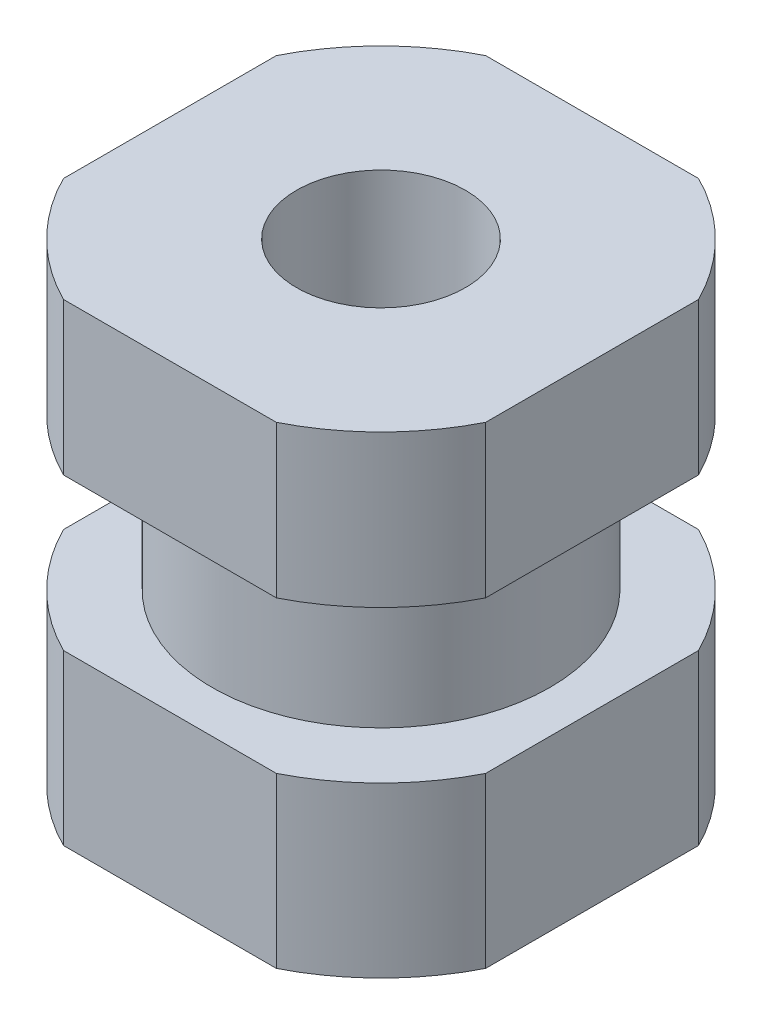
ISO-10303-21;
HEADER;
FILE_DESCRIPTION(('STEP AP214'),'2;1');
FILE_NAME('part.step','',(''),(''),'','','');
FILE_SCHEMA(('AUTOMOTIVE_DESIGN { 1 0 10303 214 1 1 1 1 }'));
ENDSEC;
DATA;
#1=APPLICATION_CONTEXT('core data for automotive mechanical design processes');
#2=APPLICATION_PROTOCOL_DEFINITION('international standard','automotive_design',2000,#1);
#3=PRODUCT_CONTEXT('',#1,'mechanical');
#4=PRODUCT('Part','Part','',(#3));
#5=PRODUCT_RELATED_PRODUCT_CATEGORY('part','',(#4));
#6=PRODUCT_DEFINITION_FORMATION('','',#4);
#7=PRODUCT_DEFINITION_CONTEXT('part definition',#1,'design');
#8=PRODUCT_DEFINITION('design','',#6,#7);
#9=PRODUCT_DEFINITION_SHAPE('','',#8);
#10=(LENGTH_UNIT() NAMED_UNIT(*) SI_UNIT(.MILLI.,.METRE.));
#11=(NAMED_UNIT(*) PLANE_ANGLE_UNIT() SI_UNIT($,.RADIAN.));
#12=(NAMED_UNIT(*) SI_UNIT($,.STERADIAN.) SOLID_ANGLE_UNIT());
#13=UNCERTAINTY_MEASURE_WITH_UNIT(LENGTH_MEASURE(1.E-05),#10,'distance_accuracy_value','');
#14=(GEOMETRIC_REPRESENTATION_CONTEXT(3) GLOBAL_UNCERTAINTY_ASSIGNED_CONTEXT((#13)) GLOBAL_UNIT_ASSIGNED_CONTEXT((#10,
#11,#12)) REPRESENTATION_CONTEXT('',''));
#15=CARTESIAN_POINT('',(0.,0.,0.));
#16=DIRECTION('',(0.,0.,1.));
#17=DIRECTION('',(1.,0.,0.));
#18=AXIS2_PLACEMENT_3D('',#15,#16,#17);
#19=CARTESIAN_POINT('',(0.,-21.,0.));
#20=DIRECTION('',(0.,1.,0.));
#21=DIRECTION('',(-1.,0.,0.));
#22=AXIS2_PLACEMENT_3D('',#19,#20,#21);
#23=PLANE('',#22);
#24=CARTESIAN_POINT('',(0.,-21.,0.));
#25=DIRECTION('',(0.,-1.,0.));
#26=DIRECTION('',(0.,0.,-1.));
#27=AXIS2_PLACEMENT_3D('',#24,#25,#26);
#28=CIRCLE('',#27,2.5);
#29=CARTESIAN_POINT('',(0.,-21.,-2.5));
#30=VERTEX_POINT('',#29);
#31=EDGE_CURVE('E213',#30,#30,#28,.T.);
#32=ORIENTED_EDGE('',*,*,#31,.T.);
#33=EDGE_LOOP('',(#32));
#34=FACE_BOUND('',#33,.T.);
#35=CARTESIAN_POINT('',(0.,-21.,0.));
#36=DIRECTION('',(0.,1.,0.));
#37=DIRECTION('',(-1.,0.,0.));
#38=AXIS2_PLACEMENT_3D('',#35,#36,#37);
#39=CIRCLE('',#38,7.);
#40=CARTESIAN_POINT('',(-3.15238005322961,-21.,-6.25));
#41=VERTEX_POINT('',#40);
#42=CARTESIAN_POINT('',(-6.25,-21.,-3.15238005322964));
#43=VERTEX_POINT('',#42);
#44=EDGE_CURVE('E188',#41,#43,#39,.T.);
#45=ORIENTED_EDGE('',*,*,#44,.T.);
#46=DIRECTION('',(0.,0.,1.));
#47=VECTOR('',#46,1.);
#48=CARTESIAN_POINT('',(-6.25,-21.,0.));
#49=LINE('',#48,#47);
#50=CARTESIAN_POINT('',(-6.25,-21.,3.15238005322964));
#51=VERTEX_POINT('',#50);
#52=EDGE_CURVE('E155',#43,#51,#49,.T.);
#53=ORIENTED_EDGE('',*,*,#52,.T.);
#54=CARTESIAN_POINT('',(-3.15238005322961,-21.,6.25));
#55=VERTEX_POINT('',#54);
#56=EDGE_CURVE('E139',#51,#55,#39,.T.);
#57=ORIENTED_EDGE('',*,*,#56,.T.);
#58=DIRECTION('',(1.,0.,0.));
#59=VECTOR('',#58,1.);
#60=CARTESIAN_POINT('',(0.,-21.,6.25));
#61=LINE('',#60,#59);
#62=CARTESIAN_POINT('',(3.15238005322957,-21.,6.25));
#63=VERTEX_POINT('',#62);
#64=EDGE_CURVE('E258',#55,#63,#61,.T.);
#65=ORIENTED_EDGE('',*,*,#64,.T.);
#66=CARTESIAN_POINT('',(6.25,-21.,3.15238005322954));
#67=VERTEX_POINT('',#66);
#68=EDGE_CURVE('E187',#63,#67,#39,.T.);
#69=ORIENTED_EDGE('',*,*,#68,.T.);
#70=DIRECTION('',(0.,0.,-1.));
#71=VECTOR('',#70,1.);
#72=CARTESIAN_POINT('',(6.25,-21.,0.));
#73=LINE('',#72,#71);
#74=CARTESIAN_POINT('',(6.25,-21.,-3.15238005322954));
#75=VERTEX_POINT('',#74);
#76=EDGE_CURVE('E241',#67,#75,#73,.T.);
#77=ORIENTED_EDGE('',*,*,#76,.T.);
#78=CARTESIAN_POINT('',(3.15238005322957,-21.,-6.25));
#79=VERTEX_POINT('',#78);
#80=EDGE_CURVE('E288',#75,#79,#39,.T.);
#81=ORIENTED_EDGE('',*,*,#80,.T.);
#82=DIRECTION('',(-1.,0.,0.));
#83=VECTOR('',#82,1.);
#84=CARTESIAN_POINT('',(0.,-21.,-6.25));
#85=LINE('',#84,#83);
#86=EDGE_CURVE('E226',#79,#41,#85,.T.);
#87=ORIENTED_EDGE('',*,*,#86,.T.);
#88=EDGE_LOOP('',(#45,#53,#57,#65,#69,#77,#81,#87));
#89=FACE_BOUND('',#88,.T.);
#90=ADVANCED_FACE('F16',(#34,#89),#23,.T.);
#91=CARTESIAN_POINT('',(0.,-21.,0.));
#92=DIRECTION('',(0.,1.,0.));
#93=DIRECTION('',(-1.,0.,0.));
#94=AXIS2_PLACEMENT_3D('',#91,#92,#93);
#95=CYLINDRICAL_SURFACE('',#94,7.);
#96=ORIENTED_EDGE('',*,*,#56,.F.);
#97=DIRECTION('',(0.,1.,0.));
#98=VECTOR('',#97,1.);
#99=CARTESIAN_POINT('',(-6.25,-21.,3.15238005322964));
#100=LINE('',#99,#98);
#101=CARTESIAN_POINT('',(-6.25,-25.5,3.15238005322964));
#102=VERTEX_POINT('',#101);
#103=EDGE_CURVE('E160',#51,#102,#100,.F.);
#104=ORIENTED_EDGE('',*,*,#103,.T.);
#105=CARTESIAN_POINT('',(0.,-25.5,0.));
#106=DIRECTION('',(0.,1.,0.));
#107=DIRECTION('',(-1.,0.,0.));
#108=AXIS2_PLACEMENT_3D('',#105,#106,#107);
#109=CIRCLE('',#108,7.);
#110=CARTESIAN_POINT('',(-3.15238005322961,-25.5,6.25));
#111=VERTEX_POINT('',#110);
#112=EDGE_CURVE('E189',#102,#111,#109,.T.);
#113=ORIENTED_EDGE('',*,*,#112,.T.);
#114=DIRECTION('',(0.,1.,0.));
#115=VECTOR('',#114,1.);
#116=CARTESIAN_POINT('',(-3.15238005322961,-21.,6.25));
#117=LINE('',#116,#115);
#118=EDGE_CURVE('E252',#111,#55,#117,.T.);
#119=ORIENTED_EDGE('',*,*,#118,.T.);
#120=EDGE_LOOP('',(#96,#104,#113,#119));
#121=FACE_BOUND('',#120,.T.);
#122=ADVANCED_FACE('F274',(#121),#95,.T.);
#123=CARTESIAN_POINT('',(-3.15238005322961,-25.5,-6.25));
#124=VERTEX_POINT('',#123);
#125=CARTESIAN_POINT('',(-6.25,-25.5,-3.15238005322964));
#126=VERTEX_POINT('',#125);
#127=EDGE_CURVE('E193',#124,#126,#109,.T.);
#128=ORIENTED_EDGE('',*,*,#127,.T.);
#129=DIRECTION('',(0.,1.,0.));
#130=VECTOR('',#129,1.);
#131=CARTESIAN_POINT('',(-6.25,-21.,-3.15238005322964));
#132=LINE('',#131,#130);
#133=EDGE_CURVE('E30',#126,#43,#132,.T.);
#134=ORIENTED_EDGE('',*,*,#133,.T.);
#135=ORIENTED_EDGE('',*,*,#44,.F.);
#136=DIRECTION('',(0.,1.,0.));
#137=VECTOR('',#136,1.);
#138=CARTESIAN_POINT('',(-3.15238005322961,-21.,-6.25));
#139=LINE('',#138,#137);
#140=EDGE_CURVE('E223',#41,#124,#139,.F.);
#141=ORIENTED_EDGE('',*,*,#140,.T.);
#142=EDGE_LOOP('',(#128,#134,#135,#141));
#143=FACE_BOUND('',#142,.T.);
#144=ADVANCED_FACE('F294',(#143),#95,.T.);
#145=ORIENTED_EDGE('',*,*,#68,.F.);
#146=DIRECTION('',(0.,1.,0.));
#147=VECTOR('',#146,1.);
#148=CARTESIAN_POINT('',(3.15238005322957,-21.,6.25));
#149=LINE('',#148,#147);
#150=CARTESIAN_POINT('',(3.15238005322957,-25.5,6.25));
#151=VERTEX_POINT('',#150);
#152=EDGE_CURVE('E255',#63,#151,#149,.F.);
#153=ORIENTED_EDGE('',*,*,#152,.T.);
#154=CARTESIAN_POINT('',(6.25,-25.5,3.15238005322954));
#155=VERTEX_POINT('',#154);
#156=EDGE_CURVE('E192',#151,#155,#109,.T.);
#157=ORIENTED_EDGE('',*,*,#156,.T.);
#158=DIRECTION('',(0.,1.,0.));
#159=VECTOR('',#158,1.);
#160=CARTESIAN_POINT('',(6.25,-21.,3.15238005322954));
#161=LINE('',#160,#159);
#162=EDGE_CURVE('E235',#155,#67,#161,.T.);
#163=ORIENTED_EDGE('',*,*,#162,.T.);
#164=EDGE_LOOP('',(#145,#153,#157,#163));
#165=FACE_BOUND('',#164,.T.);
#166=ADVANCED_FACE('F285',(#165),#95,.T.);
#167=ORIENTED_EDGE('',*,*,#80,.F.);
#168=DIRECTION('',(0.,1.,0.));
#169=VECTOR('',#168,1.);
#170=CARTESIAN_POINT('',(6.25,-21.,-3.15238005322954));
#171=LINE('',#170,#169);
#172=CARTESIAN_POINT('',(6.25,-25.5,-3.15238005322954));
#173=VERTEX_POINT('',#172);
#174=EDGE_CURVE('E238',#75,#173,#171,.F.);
#175=ORIENTED_EDGE('',*,*,#174,.T.);
#176=CARTESIAN_POINT('',(3.15238005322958,-25.5,-6.25));
#177=VERTEX_POINT('',#176);
#178=EDGE_CURVE('E295',#173,#177,#109,.T.);
#179=ORIENTED_EDGE('',*,*,#178,.T.);
#180=DIRECTION('',(0.,1.,0.));
#181=VECTOR('',#180,1.);
#182=CARTESIAN_POINT('',(3.15238005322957,-21.,-6.25));
#183=LINE('',#182,#181);
#184=EDGE_CURVE('E38',#177,#79,#183,.T.);
#185=ORIENTED_EDGE('',*,*,#184,.T.);
#186=EDGE_LOOP('',(#167,#175,#179,#185));
#187=FACE_BOUND('',#186,.T.);
#188=ADVANCED_FACE('F299',(#187),#95,.T.);
#189=CARTESIAN_POINT('',(-7.,-25.5,0.));
#190=DIRECTION('',(0.,-1.,0.));
#191=DIRECTION('',(1.,0.,0.));
#192=AXIS2_PLACEMENT_3D('',#189,#190,#191);
#193=PLANE('',#192);
#194=CARTESIAN_POINT('',(0.,-25.5,0.));
#195=DIRECTION('',(0.,1.,0.));
#196=DIRECTION('',(-1.,0.,0.));
#197=AXIS2_PLACEMENT_3D('',#194,#195,#196);
#198=CIRCLE('',#197,5.);
#199=CARTESIAN_POINT('',(-5.00000000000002,-25.5,0.));
#200=VERTEX_POINT('',#199);
#201=EDGE_CURVE('E194',#200,#200,#198,.T.);
#202=ORIENTED_EDGE('',*,*,#201,.T.);
#203=EDGE_LOOP('',(#202));
#204=FACE_BOUND('',#203,.T.);
#205=ORIENTED_EDGE('',*,*,#112,.F.);
#206=DIRECTION('',(0.,0.,-1.));
#207=VECTOR('',#206,1.);
#208=CARTESIAN_POINT('',(-6.25,-25.5,0.));
#209=LINE('',#208,#207);
#210=EDGE_CURVE('E267',#102,#126,#209,.T.);
#211=ORIENTED_EDGE('',*,*,#210,.T.);
#212=ORIENTED_EDGE('',*,*,#127,.F.);
#213=DIRECTION('',(1.,0.,0.));
#214=VECTOR('',#213,1.);
#215=CARTESIAN_POINT('',(-7.,-25.5,-6.25));
#216=LINE('',#215,#214);
#217=EDGE_CURVE('E149',#124,#177,#216,.T.);
#218=ORIENTED_EDGE('',*,*,#217,.T.);
#219=ORIENTED_EDGE('',*,*,#178,.F.);
#220=DIRECTION('',(0.,0.,1.));
#221=VECTOR('',#220,1.);
#222=CARTESIAN_POINT('',(6.25,-25.5,0.));
#223=LINE('',#222,#221);
#224=EDGE_CURVE('E232',#173,#155,#223,.T.);
#225=ORIENTED_EDGE('',*,*,#224,.T.);
#226=ORIENTED_EDGE('',*,*,#156,.F.);
#227=DIRECTION('',(-1.,0.,0.));
#228=VECTOR('',#227,1.);
#229=CARTESIAN_POINT('',(-7.,-25.5,6.25));
#230=LINE('',#229,#228);
#231=EDGE_CURVE('E249',#151,#111,#230,.T.);
#232=ORIENTED_EDGE('',*,*,#231,.T.);
#233=EDGE_LOOP('',(#205,#211,#212,#218,#219,#225,#226,#232));
#234=FACE_BOUND('',#233,.T.);
#235=ADVANCED_FACE('F276',(#204,#234),#193,.T.);
#236=CARTESIAN_POINT('',(-5.,-30.,0.));
#237=DIRECTION('',(0.,1.,0.));
#238=DIRECTION('',(-1.,0.,0.));
#239=AXIS2_PLACEMENT_3D('',#236,#237,#238);
#240=PLANE('',#239);
#241=CARTESIAN_POINT('',(0.,-30.,0.));
#242=DIRECTION('',(0.,1.,0.));
#243=DIRECTION('',(-1.,0.,0.));
#244=AXIS2_PLACEMENT_3D('',#241,#242,#243);
#245=CIRCLE('',#244,5.);
#246=CARTESIAN_POINT('',(-5.00000000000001,-30.,0.));
#247=VERTEX_POINT('',#246);
#248=EDGE_CURVE('E197',#247,#247,#245,.T.);
#249=ORIENTED_EDGE('',*,*,#248,.F.);
#250=EDGE_LOOP('',(#249));
#251=FACE_BOUND('',#250,.T.);
#252=CARTESIAN_POINT('',(0.,-30.,0.));
#253=DIRECTION('',(0.,1.,0.));
#254=DIRECTION('',(-1.,0.,0.));
#255=AXIS2_PLACEMENT_3D('',#252,#253,#254);
#256=CIRCLE('',#255,7.);
#257=CARTESIAN_POINT('',(-3.15238005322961,-30.,-6.25));
#258=VERTEX_POINT('',#257);
#259=CARTESIAN_POINT('',(-6.25,-30.,-3.15238005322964));
#260=VERTEX_POINT('',#259);
#261=EDGE_CURVE('E148',#258,#260,#256,.T.);
#262=ORIENTED_EDGE('',*,*,#261,.T.);
#263=DIRECTION('',(0.,0.,1.));
#264=VECTOR('',#263,1.);
#265=CARTESIAN_POINT('',(-6.25,-30.,0.));
#266=LINE('',#265,#264);
#267=CARTESIAN_POINT('',(-6.25,-30.,3.15238005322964));
#268=VERTEX_POINT('',#267);
#269=EDGE_CURVE('E263',#260,#268,#266,.T.);
#270=ORIENTED_EDGE('',*,*,#269,.T.);
#271=CARTESIAN_POINT('',(-3.15238005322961,-30.,6.25));
#272=VERTEX_POINT('',#271);
#273=EDGE_CURVE('E168',#268,#272,#256,.T.);
#274=ORIENTED_EDGE('',*,*,#273,.T.);
#275=DIRECTION('',(1.,0.,0.));
#276=VECTOR('',#275,1.);
#277=CARTESIAN_POINT('',(-5.,-30.,6.25));
#278=LINE('',#277,#276);
#279=CARTESIAN_POINT('',(3.15238005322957,-30.,6.25));
#280=VERTEX_POINT('',#279);
#281=EDGE_CURVE('E246',#272,#280,#278,.T.);
#282=ORIENTED_EDGE('',*,*,#281,.T.);
#283=CARTESIAN_POINT('',(6.25,-30.,3.15238005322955));
#284=VERTEX_POINT('',#283);
#285=EDGE_CURVE('E200',#280,#284,#256,.T.);
#286=ORIENTED_EDGE('',*,*,#285,.T.);
#287=DIRECTION('',(0.,0.,-1.));
#288=VECTOR('',#287,1.);
#289=CARTESIAN_POINT('',(6.25,-30.,0.));
#290=LINE('',#289,#288);
#291=CARTESIAN_POINT('',(6.25,-30.,-3.15238005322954));
#292=VERTEX_POINT('',#291);
#293=EDGE_CURVE('E209',#284,#292,#290,.T.);
#294=ORIENTED_EDGE('',*,*,#293,.T.);
#295=CARTESIAN_POINT('',(3.15238005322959,-30.,-6.25));
#296=VERTEX_POINT('',#295);
#297=EDGE_CURVE('E167',#292,#296,#256,.T.);
#298=ORIENTED_EDGE('',*,*,#297,.T.);
#299=DIRECTION('',(-1.,0.,0.));
#300=VECTOR('',#299,1.);
#301=CARTESIAN_POINT('',(-5.,-30.,-6.25));
#302=LINE('',#301,#300);
#303=EDGE_CURVE('E150',#296,#258,#302,.T.);
#304=ORIENTED_EDGE('',*,*,#303,.T.);
#305=EDGE_LOOP('',(#262,#270,#274,#282,#286,#294,#298,#304));
#306=FACE_BOUND('',#305,.T.);
#307=ADVANCED_FACE('F208',(#251,#306),#240,.T.);
#308=CARTESIAN_POINT('',(0.,-21.,0.));
#309=DIRECTION('',(0.,1.,0.));
#310=DIRECTION('',(-1.,0.,0.));
#311=AXIS2_PLACEMENT_3D('',#308,#309,#310);
#312=CYLINDRICAL_SURFACE('',#311,7.);
#313=ORIENTED_EDGE('',*,*,#273,.F.);
#314=DIRECTION('',(0.,1.,0.));
#315=VECTOR('',#314,1.);
#316=CARTESIAN_POINT('',(-6.25,-21.,3.15238005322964));
#317=LINE('',#316,#315);
#318=CARTESIAN_POINT('',(-6.25,-35.,3.15238005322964));
#319=VERTEX_POINT('',#318);
#320=EDGE_CURVE('E265',#268,#319,#317,.F.);
#321=ORIENTED_EDGE('',*,*,#320,.T.);
#322=CARTESIAN_POINT('',(0.,-35.,0.));
#323=DIRECTION('',(0.,1.,0.));
#324=DIRECTION('',(-1.,0.,0.));
#325=AXIS2_PLACEMENT_3D('',#322,#323,#324);
#326=CIRCLE('',#325,7.);
#327=CARTESIAN_POINT('',(-3.15238005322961,-35.,6.25));
#328=VERTEX_POINT('',#327);
#329=EDGE_CURVE('E157',#319,#328,#326,.T.);
#330=ORIENTED_EDGE('',*,*,#329,.T.);
#331=DIRECTION('',(0.,1.,0.));
#332=VECTOR('',#331,1.);
#333=CARTESIAN_POINT('',(-3.15238005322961,-21.,6.25));
#334=LINE('',#333,#332);
#335=EDGE_CURVE('E244',#328,#272,#334,.T.);
#336=ORIENTED_EDGE('',*,*,#335,.T.);
#337=EDGE_LOOP('',(#313,#321,#330,#336));
#338=FACE_BOUND('',#337,.T.);
#339=ADVANCED_FACE('F345',(#338),#312,.T.);
#340=CARTESIAN_POINT('',(-3.15238005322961,-35.,-6.25));
#341=VERTEX_POINT('',#340);
#342=CARTESIAN_POINT('',(-6.25,-35.,-3.15238005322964));
#343=VERTEX_POINT('',#342);
#344=EDGE_CURVE('E146',#341,#343,#326,.T.);
#345=ORIENTED_EDGE('',*,*,#344,.T.);
#346=DIRECTION('',(0.,1.,0.));
#347=VECTOR('',#346,1.);
#348=CARTESIAN_POINT('',(-6.25,-21.,-3.15238005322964));
#349=LINE('',#348,#347);
#350=EDGE_CURVE('E261',#343,#260,#349,.T.);
#351=ORIENTED_EDGE('',*,*,#350,.T.);
#352=ORIENTED_EDGE('',*,*,#261,.F.);
#353=DIRECTION('',(0.,1.,0.));
#354=VECTOR('',#353,1.);
#355=CARTESIAN_POINT('',(-3.15238005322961,-21.,-6.25));
#356=LINE('',#355,#354);
#357=EDGE_CURVE('E130',#258,#341,#356,.F.);
#358=ORIENTED_EDGE('',*,*,#357,.T.);
#359=EDGE_LOOP('',(#345,#351,#352,#358));
#360=FACE_BOUND('',#359,.T.);
#361=ADVANCED_FACE('F144',(#360),#312,.T.);
#362=ORIENTED_EDGE('',*,*,#285,.F.);
#363=DIRECTION('',(0.,1.,0.));
#364=VECTOR('',#363,1.);
#365=CARTESIAN_POINT('',(3.15238005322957,-21.,6.25));
#366=LINE('',#365,#364);
#367=CARTESIAN_POINT('',(3.15238005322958,-35.,6.25));
#368=VERTEX_POINT('',#367);
#369=EDGE_CURVE('E178',#280,#368,#366,.F.);
#370=ORIENTED_EDGE('',*,*,#369,.T.);
#371=CARTESIAN_POINT('',(6.25,-35.,3.15238005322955));
#372=VERTEX_POINT('',#371);
#373=EDGE_CURVE('E158',#368,#372,#326,.T.);
#374=ORIENTED_EDGE('',*,*,#373,.T.);
#375=DIRECTION('',(0.,1.,0.));
#376=VECTOR('',#375,1.);
#377=CARTESIAN_POINT('',(6.25,-21.,3.15238005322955));
#378=LINE('',#377,#376);
#379=EDGE_CURVE('E176',#372,#284,#378,.T.);
#380=ORIENTED_EDGE('',*,*,#379,.T.);
#381=EDGE_LOOP('',(#362,#370,#374,#380));
#382=FACE_BOUND('',#381,.T.);
#383=ADVANCED_FACE('F175',(#382),#312,.T.);
#384=ORIENTED_EDGE('',*,*,#297,.F.);
#385=DIRECTION('',(0.,1.,0.));
#386=VECTOR('',#385,1.);
#387=CARTESIAN_POINT('',(6.25,-21.,-3.15238005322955));
#388=LINE('',#387,#386);
#389=CARTESIAN_POINT('',(6.25,-35.,-3.15238005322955));
#390=VERTEX_POINT('',#389);
#391=EDGE_CURVE('E212',#292,#390,#388,.F.);
#392=ORIENTED_EDGE('',*,*,#391,.T.);
#393=CARTESIAN_POINT('',(3.15238005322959,-35.,-6.25));
#394=VERTEX_POINT('',#393);
#395=EDGE_CURVE('E154',#390,#394,#326,.T.);
#396=ORIENTED_EDGE('',*,*,#395,.T.);
#397=DIRECTION('',(0.,1.,0.));
#398=VECTOR('',#397,1.);
#399=CARTESIAN_POINT('',(3.15238005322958,-21.,-6.25));
#400=LINE('',#399,#398);
#401=EDGE_CURVE('E133',#394,#296,#400,.T.);
#402=ORIENTED_EDGE('',*,*,#401,.T.);
#403=EDGE_LOOP('',(#384,#392,#396,#402));
#404=FACE_BOUND('',#403,.T.);
#405=ADVANCED_FACE('F211',(#404),#312,.T.);
#406=CARTESIAN_POINT('',(-7.,-35.,0.));
#407=DIRECTION('',(0.,-1.,0.));
#408=DIRECTION('',(1.,0.,0.));
#409=AXIS2_PLACEMENT_3D('',#406,#407,#408);
#410=PLANE('',#409);
#411=CARTESIAN_POINT('',(0.,-35.,0.));
#412=DIRECTION('',(0.,-1.,0.));
#413=DIRECTION('',(0.,0.,-1.));
#414=AXIS2_PLACEMENT_3D('',#411,#412,#413);
#415=CIRCLE('',#414,2.5);
#416=CARTESIAN_POINT('',(0.,-35.,-2.5));
#417=VERTEX_POINT('',#416);
#418=EDGE_CURVE('E217',#417,#417,#415,.T.);
#419=ORIENTED_EDGE('',*,*,#418,.F.);
#420=EDGE_LOOP('',(#419));
#421=FACE_BOUND('',#420,.T.);
#422=ORIENTED_EDGE('',*,*,#329,.F.);
#423=DIRECTION('',(0.,0.,-1.));
#424=VECTOR('',#423,1.);
#425=CARTESIAN_POINT('',(-6.25,-35.,0.));
#426=LINE('',#425,#424);
#427=EDGE_CURVE('E11',#319,#343,#426,.T.);
#428=ORIENTED_EDGE('',*,*,#427,.T.);
#429=ORIENTED_EDGE('',*,*,#344,.F.);
#430=DIRECTION('',(1.,0.,0.));
#431=VECTOR('',#430,1.);
#432=CARTESIAN_POINT('',(-7.,-35.,-6.25));
#433=LINE('',#432,#431);
#434=EDGE_CURVE('E127',#341,#394,#433,.T.);
#435=ORIENTED_EDGE('',*,*,#434,.T.);
#436=ORIENTED_EDGE('',*,*,#395,.F.);
#437=DIRECTION('',(0.,0.,1.));
#438=VECTOR('',#437,1.);
#439=CARTESIAN_POINT('',(6.25,-35.,0.));
#440=LINE('',#439,#438);
#441=EDGE_CURVE('E138',#390,#372,#440,.T.);
#442=ORIENTED_EDGE('',*,*,#441,.T.);
#443=ORIENTED_EDGE('',*,*,#373,.F.);
#444=DIRECTION('',(-1.,0.,0.));
#445=VECTOR('',#444,1.);
#446=CARTESIAN_POINT('',(-7.,-35.,6.25));
#447=LINE('',#446,#445);
#448=EDGE_CURVE('E23',#368,#328,#447,.T.);
#449=ORIENTED_EDGE('',*,*,#448,.T.);
#450=EDGE_LOOP('',(#422,#428,#429,#435,#436,#442,#443,#449));
#451=FACE_BOUND('',#450,.T.);
#452=ADVANCED_FACE('F153',(#421,#451),#410,.T.);
#453=CARTESIAN_POINT('',(0.,-21.,0.));
#454=DIRECTION('',(0.,1.,0.));
#455=DIRECTION('',(-1.,0.,0.));
#456=AXIS2_PLACEMENT_3D('',#453,#454,#455);
#457=CYLINDRICAL_SURFACE('',#456,5.);
#458=ORIENTED_EDGE('',*,*,#248,.T.);
#459=EDGE_LOOP('',(#458));
#460=FACE_BOUND('',#459,.T.);
#461=ORIENTED_EDGE('',*,*,#201,.F.);
#462=EDGE_LOOP('',(#461));
#463=FACE_BOUND('',#462,.T.);
#464=ADVANCED_FACE('F319',(#460,#463),#457,.T.);
#465=CARTESIAN_POINT('',(6.25,-15.,-6.25));
#466=DIRECTION('',(0.,0.,-1.));
#467=DIRECTION('',(-1.,0.,0.));
#468=AXIS2_PLACEMENT_3D('',#465,#466,#467);
#469=PLANE('',#468);
#470=ORIENTED_EDGE('',*,*,#303,.F.);
#471=ORIENTED_EDGE('',*,*,#401,.F.);
#472=ORIENTED_EDGE('',*,*,#434,.F.);
#473=ORIENTED_EDGE('',*,*,#357,.F.);
#474=EDGE_LOOP('',(#470,#471,#472,#473));
#475=FACE_BOUND('',#474,.T.);
#476=ADVANCED_FACE('F129',(#475),#469,.T.);
#477=CARTESIAN_POINT('',(6.25,-15.,-6.25));
#478=DIRECTION('',(1.,0.,0.));
#479=DIRECTION('',(0.,1.,0.));
#480=AXIS2_PLACEMENT_3D('',#477,#478,#479);
#481=PLANE('',#480);
#482=ORIENTED_EDGE('',*,*,#293,.F.);
#483=ORIENTED_EDGE('',*,*,#379,.F.);
#484=ORIENTED_EDGE('',*,*,#441,.F.);
#485=ORIENTED_EDGE('',*,*,#391,.F.);
#486=EDGE_LOOP('',(#482,#483,#484,#485));
#487=FACE_BOUND('',#486,.T.);
#488=ADVANCED_FACE('F313',(#487),#481,.T.);
#489=CARTESIAN_POINT('',(6.25,-15.,6.25));
#490=DIRECTION('',(0.,0.,1.));
#491=DIRECTION('',(1.,0.,0.));
#492=AXIS2_PLACEMENT_3D('',#489,#490,#491);
#493=PLANE('',#492);
#494=ORIENTED_EDGE('',*,*,#281,.F.);
#495=ORIENTED_EDGE('',*,*,#335,.F.);
#496=ORIENTED_EDGE('',*,*,#448,.F.);
#497=ORIENTED_EDGE('',*,*,#369,.F.);
#498=EDGE_LOOP('',(#494,#495,#496,#497));
#499=FACE_BOUND('',#498,.T.);
#500=ADVANCED_FACE('F314',(#499),#493,.T.);
#501=CARTESIAN_POINT('',(-6.25,-15.,-6.25));
#502=DIRECTION('',(-1.,0.,0.));
#503=DIRECTION('',(0.,-1.,0.));
#504=AXIS2_PLACEMENT_3D('',#501,#502,#503);
#505=PLANE('',#504);
#506=ORIENTED_EDGE('',*,*,#269,.F.);
#507=ORIENTED_EDGE('',*,*,#350,.F.);
#508=ORIENTED_EDGE('',*,*,#427,.F.);
#509=ORIENTED_EDGE('',*,*,#320,.F.);
#510=EDGE_LOOP('',(#506,#507,#508,#509));
#511=FACE_BOUND('',#510,.T.);
#512=ADVANCED_FACE('F303',(#511),#505,.T.);
#513=ORIENTED_EDGE('',*,*,#184,.F.);
#514=ORIENTED_EDGE('',*,*,#217,.F.);
#515=ORIENTED_EDGE('',*,*,#140,.F.);
#516=ORIENTED_EDGE('',*,*,#86,.F.);
#517=EDGE_LOOP('',(#513,#514,#515,#516));
#518=FACE_BOUND('',#517,.T.);
#519=ADVANCED_FACE('F300',(#518),#469,.T.);
#520=ORIENTED_EDGE('',*,*,#162,.F.);
#521=ORIENTED_EDGE('',*,*,#224,.F.);
#522=ORIENTED_EDGE('',*,*,#174,.F.);
#523=ORIENTED_EDGE('',*,*,#76,.F.);
#524=EDGE_LOOP('',(#520,#521,#522,#523));
#525=FACE_BOUND('',#524,.T.);
#526=ADVANCED_FACE('F302',(#525),#481,.T.);
#527=ORIENTED_EDGE('',*,*,#118,.F.);
#528=ORIENTED_EDGE('',*,*,#231,.F.);
#529=ORIENTED_EDGE('',*,*,#152,.F.);
#530=ORIENTED_EDGE('',*,*,#64,.F.);
#531=EDGE_LOOP('',(#527,#528,#529,#530));
#532=FACE_BOUND('',#531,.T.);
#533=ADVANCED_FACE('F282',(#532),#493,.T.);
#534=ORIENTED_EDGE('',*,*,#133,.F.);
#535=ORIENTED_EDGE('',*,*,#210,.F.);
#536=ORIENTED_EDGE('',*,*,#103,.F.);
#537=ORIENTED_EDGE('',*,*,#52,.F.);
#538=EDGE_LOOP('',(#534,#535,#536,#537));
#539=FACE_BOUND('',#538,.T.);
#540=ADVANCED_FACE('F317',(#539),#505,.T.);
#541=CARTESIAN_POINT('',(0.,-35.,0.));
#542=DIRECTION('',(0.,-1.,0.));
#543=DIRECTION('',(0.,0.,-1.));
#544=AXIS2_PLACEMENT_3D('',#541,#542,#543);
#545=CYLINDRICAL_SURFACE('',#544,2.5);
#546=ORIENTED_EDGE('',*,*,#31,.F.);
#547=EDGE_LOOP('',(#546));
#548=FACE_BOUND('',#547,.T.);
#549=ORIENTED_EDGE('',*,*,#418,.T.);
#550=EDGE_LOOP('',(#549));
#551=FACE_BOUND('',#550,.T.);
#552=ADVANCED_FACE('F328',(#548,#551),#545,.F.);
#553=CLOSED_SHELL('',(#90,#122,#144,#166,#188,#235,#307,#339,#361,#383,#405,#452,#464,#476,#488,
#500,#512,#519,#526,#533,#540,#552));
#554=MANIFOLD_SOLID_BREP('B1',#553);
#555=ADVANCED_BREP_SHAPE_REPRESENTATION('',(#18,#554),#14);
#556=SHAPE_DEFINITION_REPRESENTATION(#9,#555);
ENDSEC;
END-ISO-10303-21;
